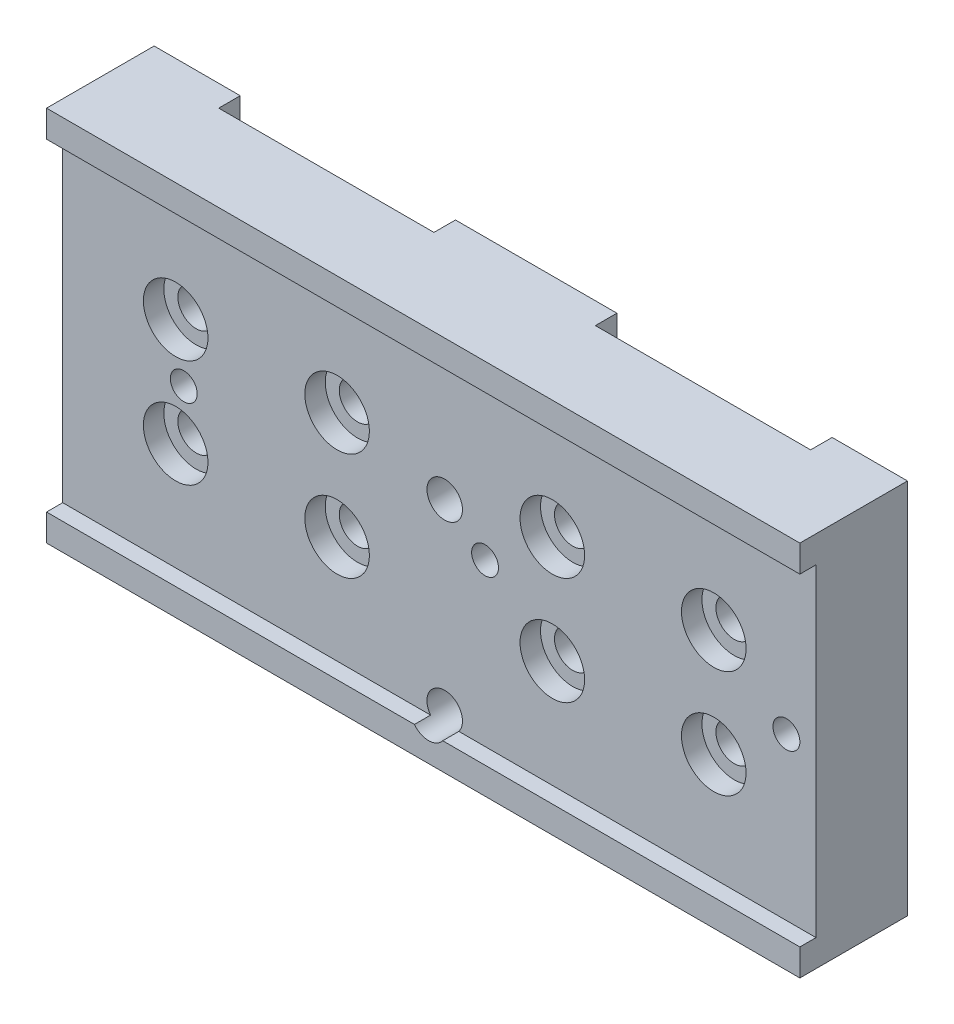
ISO-10303-21;
HEADER;
FILE_DESCRIPTION(('STEP AP214'),'2;1');
FILE_NAME('part.step','',(''),(''),'','','');
FILE_SCHEMA(('AUTOMOTIVE_DESIGN { 1 0 10303 214 1 1 1 1 }'));
ENDSEC;
DATA;
#1=APPLICATION_CONTEXT('core data for automotive mechanical design processes');
#2=APPLICATION_PROTOCOL_DEFINITION('international standard','automotive_design',2000,#1);
#3=PRODUCT_CONTEXT('',#1,'mechanical');
#4=PRODUCT('Part','Part','',(#3));
#5=PRODUCT_RELATED_PRODUCT_CATEGORY('part','',(#4));
#6=PRODUCT_DEFINITION_FORMATION('','',#4);
#7=PRODUCT_DEFINITION_CONTEXT('part definition',#1,'design');
#8=PRODUCT_DEFINITION('design','',#6,#7);
#9=PRODUCT_DEFINITION_SHAPE('','',#8);
#10=(LENGTH_UNIT() NAMED_UNIT(*) SI_UNIT(.MILLI.,.METRE.));
#11=(NAMED_UNIT(*) PLANE_ANGLE_UNIT() SI_UNIT($,.RADIAN.));
#12=(NAMED_UNIT(*) SI_UNIT($,.STERADIAN.) SOLID_ANGLE_UNIT());
#13=UNCERTAINTY_MEASURE_WITH_UNIT(LENGTH_MEASURE(1.E-05),#10,'distance_accuracy_value','');
#14=(GEOMETRIC_REPRESENTATION_CONTEXT(3) GLOBAL_UNCERTAINTY_ASSIGNED_CONTEXT((#13)) GLOBAL_UNIT_ASSIGNED_CONTEXT((#10,
#11,#12)) REPRESENTATION_CONTEXT('',''));
#15=CARTESIAN_POINT('',(0.,0.,0.));
#16=DIRECTION('',(0.,0.,1.));
#17=DIRECTION('',(1.,0.,0.));
#18=AXIS2_PLACEMENT_3D('',#15,#16,#17);
#19=CARTESIAN_POINT('',(12.,0.8,10.));
#20=DIRECTION('',(0.,-1.,0.));
#21=DIRECTION('',(1.,0.,0.));
#22=AXIS2_PLACEMENT_3D('',#19,#20,#21);
#23=PLANE('',#22);
#24=DIRECTION('',(-1.,0.,0.));
#25=VECTOR('',#24,1.);
#26=CARTESIAN_POINT('',(12.,0.8,10.));
#27=LINE('',#26,#25);
#28=CARTESIAN_POINT('',(-23.8124404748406,0.8,10.));
#29=VERTEX_POINT('',#28);
#30=CARTESIAN_POINT('',(-58.,0.799999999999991,10.));
#31=VERTEX_POINT('',#30);
#32=EDGE_CURVE('E147',#29,#31,#27,.T.);
#33=ORIENTED_EDGE('',*,*,#32,.F.);
#34=DIRECTION('',(0.,0.,-1.));
#35=VECTOR('',#34,1.);
#36=CARTESIAN_POINT('',(-23.8124404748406,0.8,0.));
#37=LINE('',#36,#35);
#38=CARTESIAN_POINT('',(-23.8124404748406,0.8,8.5));
#39=VERTEX_POINT('',#38);
#40=EDGE_CURVE('E11',#29,#39,#37,.T.);
#41=ORIENTED_EDGE('',*,*,#40,.T.);
#42=DIRECTION('',(-1.,0.,0.));
#43=VECTOR('',#42,1.);
#44=CARTESIAN_POINT('',(12.,0.8,8.5));
#45=LINE('',#44,#43);
#46=CARTESIAN_POINT('',(-58.,0.799999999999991,8.5));
#47=VERTEX_POINT('',#46);
#48=EDGE_CURVE('E160',#39,#47,#45,.T.);
#49=ORIENTED_EDGE('',*,*,#48,.T.);
#50=DIRECTION('',(0.,0.,1.));
#51=VECTOR('',#50,1.);
#52=CARTESIAN_POINT('',(-58.,0.799999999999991,10.));
#53=LINE('',#52,#51);
#54=EDGE_CURVE('E154',#47,#31,#53,.T.);
#55=ORIENTED_EDGE('',*,*,#54,.T.);
#56=EDGE_LOOP('',(#33,#41,#49,#55));
#57=FACE_BOUND('',#56,.T.);
#58=ADVANCED_FACE('F16',(#57),#23,.F.);
#59=CARTESIAN_POINT('',(0.,0.,10.));
#60=DIRECTION('',(0.,0.,-1.));
#61=DIRECTION('',(-1.,0.,0.));
#62=AXIS2_PLACEMENT_3D('',#59,#60,#61);
#63=PLANE('',#62);
#64=CARTESIAN_POINT('',(12.,0.8,10.));
#65=VERTEX_POINT('',#64);
#66=CARTESIAN_POINT('',(-21.1875595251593,0.8,10.));
#67=VERTEX_POINT('',#66);
#68=EDGE_CURVE('E150',#65,#67,#27,.T.);
#69=ORIENTED_EDGE('',*,*,#68,.T.);
#70=CARTESIAN_POINT('',(-22.5,1.80000000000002,10.));
#71=DIRECTION('',(0.,0.,-1.));
#72=DIRECTION('',(-1.,0.,0.));
#73=AXIS2_PLACEMENT_3D('',#70,#71,#72);
#74=CIRCLE('',#73,1.65);
#75=EDGE_CURVE('E31',#67,#29,#74,.T.);
#76=ORIENTED_EDGE('',*,*,#75,.T.);
#77=ORIENTED_EDGE('',*,*,#32,.T.);
#78=DIRECTION('',(0.,-1.,0.));
#79=VECTOR('',#78,1.);
#80=CARTESIAN_POINT('',(-58.,33.3,10.));
#81=LINE('',#80,#79);
#82=CARTESIAN_POINT('',(-58.,-1.7,10.));
#83=VERTEX_POINT('',#82);
#84=EDGE_CURVE('E306',#31,#83,#81,.T.);
#85=ORIENTED_EDGE('',*,*,#84,.T.);
#86=DIRECTION('',(1.,0.,0.));
#87=VECTOR('',#86,1.);
#88=CARTESIAN_POINT('',(12.,-1.7,10.));
#89=LINE('',#88,#87);
#90=CARTESIAN_POINT('',(12.,-1.7,10.));
#91=VERTEX_POINT('',#90);
#92=EDGE_CURVE('E310',#83,#91,#89,.T.);
#93=ORIENTED_EDGE('',*,*,#92,.T.);
#94=DIRECTION('',(0.,1.,0.));
#95=VECTOR('',#94,1.);
#96=CARTESIAN_POINT('',(12.,33.3,10.));
#97=LINE('',#96,#95);
#98=EDGE_CURVE('E301',#91,#65,#97,.T.);
#99=ORIENTED_EDGE('',*,*,#98,.T.);
#100=EDGE_LOOP('',(#69,#76,#77,#85,#93,#99));
#101=FACE_BOUND('',#100,.T.);
#102=ADVANCED_FACE('F146',(#101),#63,.F.);
#103=CARTESIAN_POINT('',(0.,0.,0.));
#104=DIRECTION('',(0.,0.,-1.));
#105=DIRECTION('',(-1.,0.,0.));
#106=AXIS2_PLACEMENT_3D('',#103,#104,#105);
#107=PLANE('',#106);
#108=DIRECTION('',(0.,-1.,0.));
#109=VECTOR('',#108,1.);
#110=CARTESIAN_POINT('',(-50.,33.3,0.));
#111=LINE('',#110,#109);
#112=CARTESIAN_POINT('',(-50.,33.3,0.));
#113=VERTEX_POINT('',#112);
#114=CARTESIAN_POINT('',(-50.,-1.7,0.));
#115=VERTEX_POINT('',#114);
#116=EDGE_CURVE('E265',#113,#115,#111,.T.);
#117=ORIENTED_EDGE('',*,*,#116,.T.);
#118=DIRECTION('',(1.,0.,0.));
#119=VECTOR('',#118,1.);
#120=CARTESIAN_POINT('',(12.,-1.7,0.));
#121=LINE('',#120,#119);
#122=CARTESIAN_POINT('',(-58.,-1.7,0.));
#123=VERTEX_POINT('',#122);
#124=EDGE_CURVE('E323',#123,#115,#121,.T.);
#125=ORIENTED_EDGE('',*,*,#124,.F.);
#126=DIRECTION('',(0.,-1.,0.));
#127=VECTOR('',#126,1.);
#128=CARTESIAN_POINT('',(-58.,33.3,0.));
#129=LINE('',#128,#127);
#130=CARTESIAN_POINT('',(-58.,33.3,0.));
#131=VERTEX_POINT('',#130);
#132=EDGE_CURVE('E319',#131,#123,#129,.T.);
#133=ORIENTED_EDGE('',*,*,#132,.F.);
#134=DIRECTION('',(-1.,0.,0.));
#135=VECTOR('',#134,1.);
#136=CARTESIAN_POINT('',(12.,33.3,0.));
#137=LINE('',#136,#135);
#138=EDGE_CURVE('E315',#113,#131,#137,.T.);
#139=ORIENTED_EDGE('',*,*,#138,.F.);
#140=EDGE_LOOP('',(#117,#125,#133,#139));
#141=FACE_BOUND('',#140,.T.);
#142=ADVANCED_FACE('F445',(#141),#107,.T.);
#143=CARTESIAN_POINT('',(9.25,15.8,0.));
#144=DIRECTION('',(0.,0.,1.));
#145=DIRECTION('',(1.,0.,0.));
#146=AXIS2_PLACEMENT_3D('',#143,#144,#145);
#147=CIRCLE('',#146,1.25);
#148=CARTESIAN_POINT('',(10.5,15.8,0.));
#149=VERTEX_POINT('',#148);
#150=EDGE_CURVE('E388',#149,#149,#147,.T.);
#151=ORIENTED_EDGE('',*,*,#150,.T.);
#152=EDGE_LOOP('',(#151));
#153=FACE_BOUND('',#152,.T.);
#154=DIRECTION('',(0.,-1.,0.));
#155=VECTOR('',#154,1.);
#156=CARTESIAN_POINT('',(5.,33.3,0.));
#157=LINE('',#156,#155);
#158=CARTESIAN_POINT('',(5.,33.3,0.));
#159=VERTEX_POINT('',#158);
#160=CARTESIAN_POINT('',(5.,-1.7,0.));
#161=VERTEX_POINT('',#160);
#162=EDGE_CURVE('E292',#159,#161,#157,.T.);
#163=ORIENTED_EDGE('',*,*,#162,.F.);
#164=CARTESIAN_POINT('',(12.,33.3,0.));
#165=VERTEX_POINT('',#164);
#166=EDGE_CURVE('E316',#165,#159,#137,.T.);
#167=ORIENTED_EDGE('',*,*,#166,.F.);
#168=DIRECTION('',(0.,1.,0.));
#169=VECTOR('',#168,1.);
#170=CARTESIAN_POINT('',(12.,33.3,0.));
#171=LINE('',#170,#169);
#172=CARTESIAN_POINT('',(12.,-1.7,0.));
#173=VERTEX_POINT('',#172);
#174=EDGE_CURVE('E294',#173,#165,#171,.T.);
#175=ORIENTED_EDGE('',*,*,#174,.F.);
#176=EDGE_CURVE('E322',#161,#173,#121,.T.);
#177=ORIENTED_EDGE('',*,*,#176,.F.);
#178=EDGE_LOOP('',(#163,#167,#175,#177));
#179=FACE_BOUND('',#178,.T.);
#180=ADVANCED_FACE('F600',(#153,#179),#107,.T.);
#181=CARTESIAN_POINT('',(12.,33.3,10.));
#182=DIRECTION('',(-1.,0.,0.));
#183=DIRECTION('',(0.,-1.,0.));
#184=AXIS2_PLACEMENT_3D('',#181,#182,#183);
#185=PLANE('',#184);
#186=DIRECTION('',(0.,-1.,0.));
#187=VECTOR('',#186,1.);
#188=CARTESIAN_POINT('',(12.,0.8,8.5));
#189=LINE('',#188,#187);
#190=CARTESIAN_POINT('',(12.,30.8,8.5));
#191=VERTEX_POINT('',#190);
#192=CARTESIAN_POINT('',(12.,0.8,8.5));
#193=VERTEX_POINT('',#192);
#194=EDGE_CURVE('E393',#191,#193,#189,.T.);
#195=ORIENTED_EDGE('',*,*,#194,.T.);
#196=DIRECTION('',(0.,0.,1.));
#197=VECTOR('',#196,1.);
#198=CARTESIAN_POINT('',(12.,0.8,10.));
#199=LINE('',#198,#197);
#200=EDGE_CURVE('E169',#193,#65,#199,.T.);
#201=ORIENTED_EDGE('',*,*,#200,.T.);
#202=ORIENTED_EDGE('',*,*,#98,.F.);
#203=DIRECTION('',(0.,0.,-1.));
#204=VECTOR('',#203,1.);
#205=CARTESIAN_POINT('',(12.,-1.7,10.));
#206=LINE('',#205,#204);
#207=EDGE_CURVE('E312',#91,#173,#206,.T.);
#208=ORIENTED_EDGE('',*,*,#207,.T.);
#209=ORIENTED_EDGE('',*,*,#174,.T.);
#210=DIRECTION('',(0.,0.,-1.));
#211=VECTOR('',#210,1.);
#212=CARTESIAN_POINT('',(12.,33.3,10.));
#213=LINE('',#212,#211);
#214=CARTESIAN_POINT('',(12.,33.3,10.));
#215=VERTEX_POINT('',#214);
#216=EDGE_CURVE('E335',#215,#165,#213,.T.);
#217=ORIENTED_EDGE('',*,*,#216,.F.);
#218=CARTESIAN_POINT('',(12.,30.8,10.));
#219=VERTEX_POINT('',#218);
#220=EDGE_CURVE('E304',#219,#215,#97,.T.);
#221=ORIENTED_EDGE('',*,*,#220,.F.);
#222=DIRECTION('',(0.,0.,-1.));
#223=VECTOR('',#222,1.);
#224=CARTESIAN_POINT('',(12.,30.8,10.));
#225=LINE('',#224,#223);
#226=EDGE_CURVE('E39',#219,#191,#225,.T.);
#227=ORIENTED_EDGE('',*,*,#226,.T.);
#228=EDGE_LOOP('',(#195,#201,#202,#208,#209,#217,#221,#227));
#229=FACE_BOUND('',#228,.T.);
#230=ADVANCED_FACE('F18',(#229),#185,.F.);
#231=CARTESIAN_POINT('',(12.,33.3,10.));
#232=DIRECTION('',(0.,-1.,0.));
#233=DIRECTION('',(1.,0.,0.));
#234=AXIS2_PLACEMENT_3D('',#231,#232,#233);
#235=PLANE('',#234);
#236=DIRECTION('',(-1.,0.,0.));
#237=VECTOR('',#236,1.);
#238=CARTESIAN_POINT('',(-50.,33.3,2.));
#239=LINE('',#238,#237);
#240=CARTESIAN_POINT('',(-30.,33.3,2.));
#241=VERTEX_POINT('',#240);
#242=CARTESIAN_POINT('',(-50.,33.3,2.));
#243=VERTEX_POINT('',#242);
#244=EDGE_CURVE('E250',#241,#243,#239,.T.);
#245=ORIENTED_EDGE('',*,*,#244,.T.);
#246=DIRECTION('',(0.,0.,-1.));
#247=VECTOR('',#246,1.);
#248=CARTESIAN_POINT('',(-50.,33.3,0.));
#249=LINE('',#248,#247);
#250=EDGE_CURVE('E254',#243,#113,#249,.T.);
#251=ORIENTED_EDGE('',*,*,#250,.T.);
#252=ORIENTED_EDGE('',*,*,#138,.T.);
#253=DIRECTION('',(0.,0.,-1.));
#254=VECTOR('',#253,1.);
#255=CARTESIAN_POINT('',(-58.,33.3,10.));
#256=LINE('',#255,#254);
#257=CARTESIAN_POINT('',(-58.,33.3,10.));
#258=VERTEX_POINT('',#257);
#259=EDGE_CURVE('E332',#258,#131,#256,.T.);
#260=ORIENTED_EDGE('',*,*,#259,.F.);
#261=DIRECTION('',(-1.,0.,0.));
#262=VECTOR('',#261,1.);
#263=CARTESIAN_POINT('',(12.,33.3,10.));
#264=LINE('',#263,#262);
#265=EDGE_CURVE('E303',#215,#258,#264,.T.);
#266=ORIENTED_EDGE('',*,*,#265,.F.);
#267=ORIENTED_EDGE('',*,*,#216,.T.);
#268=ORIENTED_EDGE('',*,*,#166,.T.);
#269=DIRECTION('',(0.,0.,1.));
#270=VECTOR('',#269,1.);
#271=CARTESIAN_POINT('',(5.,33.3,0.));
#272=LINE('',#271,#270);
#273=CARTESIAN_POINT('',(5.,33.3,2.));
#274=VERTEX_POINT('',#273);
#275=EDGE_CURVE('E274',#159,#274,#272,.T.);
#276=ORIENTED_EDGE('',*,*,#275,.T.);
#277=DIRECTION('',(-1.,0.,0.));
#278=VECTOR('',#277,1.);
#279=CARTESIAN_POINT('',(5.,33.3,2.));
#280=LINE('',#279,#278);
#281=CARTESIAN_POINT('',(-15.,33.3,2.));
#282=VERTEX_POINT('',#281);
#283=EDGE_CURVE('E277',#274,#282,#280,.T.);
#284=ORIENTED_EDGE('',*,*,#283,.T.);
#285=DIRECTION('',(0.,0.,-1.));
#286=VECTOR('',#285,1.);
#287=CARTESIAN_POINT('',(-15.,33.3,0.));
#288=LINE('',#287,#286);
#289=CARTESIAN_POINT('',(-15.,33.3,0.));
#290=VERTEX_POINT('',#289);
#291=EDGE_CURVE('E281',#282,#290,#288,.T.);
#292=ORIENTED_EDGE('',*,*,#291,.T.);
#293=CARTESIAN_POINT('',(-30.,33.3,0.));
#294=VERTEX_POINT('',#293);
#295=EDGE_CURVE('E320',#290,#294,#137,.T.);
#296=ORIENTED_EDGE('',*,*,#295,.T.);
#297=DIRECTION('',(0.,0.,1.));
#298=VECTOR('',#297,1.);
#299=CARTESIAN_POINT('',(-30.,33.3,0.));
#300=LINE('',#299,#298);
#301=EDGE_CURVE('E247',#294,#241,#300,.T.);
#302=ORIENTED_EDGE('',*,*,#301,.T.);
#303=EDGE_LOOP('',(#245,#251,#252,#260,#266,#267,#268,#276,#284,#292,#296,#302));
#304=FACE_BOUND('',#303,.T.);
#305=ADVANCED_FACE('F420',(#304),#235,.F.);
#306=CARTESIAN_POINT('',(-58.,33.3,10.));
#307=DIRECTION('',(1.,0.,0.));
#308=DIRECTION('',(0.,1.,0.));
#309=AXIS2_PLACEMENT_3D('',#306,#307,#308);
#310=PLANE('',#309);
#311=ORIENTED_EDGE('',*,*,#84,.F.);
#312=ORIENTED_EDGE('',*,*,#54,.F.);
#313=DIRECTION('',(0.,-1.,0.));
#314=VECTOR('',#313,1.);
#315=CARTESIAN_POINT('',(-58.,0.799999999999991,8.5));
#316=LINE('',#315,#314);
#317=CARTESIAN_POINT('',(-58.,30.8,8.5));
#318=VERTEX_POINT('',#317);
#319=EDGE_CURVE('E398',#318,#47,#316,.T.);
#320=ORIENTED_EDGE('',*,*,#319,.F.);
#321=DIRECTION('',(0.,0.,-1.));
#322=VECTOR('',#321,1.);
#323=CARTESIAN_POINT('',(-58.,30.8,10.));
#324=LINE('',#323,#322);
#325=CARTESIAN_POINT('',(-58.,30.8,10.));
#326=VERTEX_POINT('',#325);
#327=EDGE_CURVE('E391',#326,#318,#324,.T.);
#328=ORIENTED_EDGE('',*,*,#327,.F.);
#329=EDGE_CURVE('E307',#258,#326,#81,.T.);
#330=ORIENTED_EDGE('',*,*,#329,.F.);
#331=ORIENTED_EDGE('',*,*,#259,.T.);
#332=ORIENTED_EDGE('',*,*,#132,.T.);
#333=DIRECTION('',(0.,0.,-1.));
#334=VECTOR('',#333,1.);
#335=CARTESIAN_POINT('',(-58.,-1.7,10.));
#336=LINE('',#335,#334);
#337=EDGE_CURVE('E329',#83,#123,#336,.T.);
#338=ORIENTED_EDGE('',*,*,#337,.F.);
#339=EDGE_LOOP('',(#311,#312,#320,#328,#330,#331,#332,#338));
#340=FACE_BOUND('',#339,.T.);
#341=ADVANCED_FACE('F402',(#340),#310,.F.);
#342=CARTESIAN_POINT('',(12.,-1.7,10.));
#343=DIRECTION('',(0.,1.,0.));
#344=DIRECTION('',(-1.,0.,0.));
#345=AXIS2_PLACEMENT_3D('',#342,#343,#344);
#346=PLANE('',#345);
#347=ORIENTED_EDGE('',*,*,#124,.T.);
#348=DIRECTION('',(0.,0.,-1.));
#349=VECTOR('',#348,1.);
#350=CARTESIAN_POINT('',(-50.,-1.7,0.));
#351=LINE('',#350,#349);
#352=CARTESIAN_POINT('',(-50.,-1.7,2.));
#353=VERTEX_POINT('',#352);
#354=EDGE_CURVE('E251',#353,#115,#351,.T.);
#355=ORIENTED_EDGE('',*,*,#354,.F.);
#356=DIRECTION('',(-1.,0.,0.));
#357=VECTOR('',#356,1.);
#358=CARTESIAN_POINT('',(-50.,-1.7,2.));
#359=LINE('',#358,#357);
#360=CARTESIAN_POINT('',(-30.,-1.7,2.));
#361=VERTEX_POINT('',#360);
#362=EDGE_CURVE('E261',#361,#353,#359,.T.);
#363=ORIENTED_EDGE('',*,*,#362,.F.);
#364=DIRECTION('',(0.,0.,1.));
#365=VECTOR('',#364,1.);
#366=CARTESIAN_POINT('',(-30.,-1.7,0.));
#367=LINE('',#366,#365);
#368=CARTESIAN_POINT('',(-30.,-1.7,0.));
#369=VERTEX_POINT('',#368);
#370=EDGE_CURVE('E258',#369,#361,#367,.T.);
#371=ORIENTED_EDGE('',*,*,#370,.F.);
#372=CARTESIAN_POINT('',(-15.,-1.7,0.));
#373=VERTEX_POINT('',#372);
#374=EDGE_CURVE('E326',#369,#373,#121,.T.);
#375=ORIENTED_EDGE('',*,*,#374,.T.);
#376=DIRECTION('',(0.,0.,-1.));
#377=VECTOR('',#376,1.);
#378=CARTESIAN_POINT('',(-15.,-1.7,0.));
#379=LINE('',#378,#377);
#380=CARTESIAN_POINT('',(-15.,-1.7,2.));
#381=VERTEX_POINT('',#380);
#382=EDGE_CURVE('E278',#381,#373,#379,.T.);
#383=ORIENTED_EDGE('',*,*,#382,.F.);
#384=DIRECTION('',(-1.,0.,0.));
#385=VECTOR('',#384,1.);
#386=CARTESIAN_POINT('',(5.,-1.7,2.));
#387=LINE('',#386,#385);
#388=CARTESIAN_POINT('',(5.,-1.7,2.));
#389=VERTEX_POINT('',#388);
#390=EDGE_CURVE('E287',#389,#381,#387,.T.);
#391=ORIENTED_EDGE('',*,*,#390,.F.);
#392=DIRECTION('',(0.,0.,1.));
#393=VECTOR('',#392,1.);
#394=CARTESIAN_POINT('',(5.,-1.7,0.));
#395=LINE('',#394,#393);
#396=EDGE_CURVE('E268',#161,#389,#395,.T.);
#397=ORIENTED_EDGE('',*,*,#396,.F.);
#398=ORIENTED_EDGE('',*,*,#176,.T.);
#399=ORIENTED_EDGE('',*,*,#207,.F.);
#400=ORIENTED_EDGE('',*,*,#92,.F.);
#401=ORIENTED_EDGE('',*,*,#337,.T.);
#402=EDGE_LOOP('',(#347,#355,#363,#371,#375,#383,#391,#397,#398,#399,#400,#401));
#403=FACE_BOUND('',#402,.T.);
#404=ADVANCED_FACE('F408',(#403),#346,.F.);
#405=ORIENTED_EDGE('',*,*,#329,.T.);
#406=DIRECTION('',(-1.,0.,0.));
#407=VECTOR('',#406,1.);
#408=CARTESIAN_POINT('',(12.,30.8,10.));
#409=LINE('',#408,#407);
#410=EDGE_CURVE('E167',#219,#326,#409,.T.);
#411=ORIENTED_EDGE('',*,*,#410,.F.);
#412=ORIENTED_EDGE('',*,*,#220,.T.);
#413=ORIENTED_EDGE('',*,*,#265,.T.);
#414=EDGE_LOOP('',(#405,#411,#412,#413));
#415=FACE_BOUND('',#414,.T.);
#416=ADVANCED_FACE('F417',(#415),#63,.F.);
#417=CARTESIAN_POINT('',(-22.5,1.80000000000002,0.));
#418=DIRECTION('',(0.,0.,-1.));
#419=DIRECTION('',(-1.,0.,0.));
#420=AXIS2_PLACEMENT_3D('',#417,#418,#419);
#421=CIRCLE('',#420,1.65);
#422=CARTESIAN_POINT('',(-24.15,1.80000000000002,0.));
#423=VERTEX_POINT('',#422);
#424=EDGE_CURVE('E151',#423,#423,#421,.T.);
#425=ORIENTED_EDGE('',*,*,#424,.F.);
#426=EDGE_LOOP('',(#425));
#427=FACE_BOUND('',#426,.T.);
#428=CARTESIAN_POINT('',(-22.5,18.8,0.));
#429=DIRECTION('',(0.,0.,-1.));
#430=DIRECTION('',(-1.,0.,0.));
#431=AXIS2_PLACEMENT_3D('',#428,#429,#430);
#432=CIRCLE('',#431,1.65);
#433=CARTESIAN_POINT('',(-24.15,18.8,0.));
#434=VERTEX_POINT('',#433);
#435=EDGE_CURVE('E359',#434,#434,#432,.T.);
#436=ORIENTED_EDGE('',*,*,#435,.F.);
#437=EDGE_LOOP('',(#436));
#438=FACE_BOUND('',#437,.T.);
#439=CARTESIAN_POINT('',(-18.75,15.8,0.));
#440=DIRECTION('',(0.,0.,1.));
#441=DIRECTION('',(1.,0.,0.));
#442=AXIS2_PLACEMENT_3D('',#439,#440,#441);
#443=CIRCLE('',#442,1.25);
#444=CARTESIAN_POINT('',(-17.5,15.8,0.));
#445=VERTEX_POINT('',#444);
#446=EDGE_CURVE('E382',#445,#445,#443,.T.);
#447=ORIENTED_EDGE('',*,*,#446,.T.);
#448=EDGE_LOOP('',(#447));
#449=FACE_BOUND('',#448,.T.);
#450=DIRECTION('',(0.,-1.,0.));
#451=VECTOR('',#450,1.);
#452=CARTESIAN_POINT('',(-30.,33.3,0.));
#453=LINE('',#452,#451);
#454=EDGE_CURVE('E257',#294,#369,#453,.T.);
#455=ORIENTED_EDGE('',*,*,#454,.F.);
#456=ORIENTED_EDGE('',*,*,#295,.F.);
#457=DIRECTION('',(0.,-1.,0.));
#458=VECTOR('',#457,1.);
#459=CARTESIAN_POINT('',(-15.,33.3,0.));
#460=LINE('',#459,#458);
#461=EDGE_CURVE('E295',#290,#373,#460,.T.);
#462=ORIENTED_EDGE('',*,*,#461,.T.);
#463=ORIENTED_EDGE('',*,*,#374,.F.);
#464=EDGE_LOOP('',(#455,#456,#462,#463));
#465=FACE_BOUND('',#464,.T.);
#466=ADVANCED_FACE('F593',(#427,#438,#449,#465),#107,.T.);
#467=CARTESIAN_POINT('',(5.,33.3,0.));
#468=DIRECTION('',(1.,0.,0.));
#469=DIRECTION('',(0.,1.,0.));
#470=AXIS2_PLACEMENT_3D('',#467,#468,#469);
#471=PLANE('',#470);
#472=ORIENTED_EDGE('',*,*,#396,.T.);
#473=DIRECTION('',(0.,-1.,0.));
#474=VECTOR('',#473,1.);
#475=CARTESIAN_POINT('',(5.,33.3,2.));
#476=LINE('',#475,#474);
#477=EDGE_CURVE('E284',#274,#389,#476,.T.);
#478=ORIENTED_EDGE('',*,*,#477,.F.);
#479=ORIENTED_EDGE('',*,*,#275,.F.);
#480=ORIENTED_EDGE('',*,*,#162,.T.);
#481=EDGE_LOOP('',(#472,#478,#479,#480));
#482=FACE_BOUND('',#481,.T.);
#483=ADVANCED_FACE('F587',(#482),#471,.F.);
#484=CARTESIAN_POINT('',(-15.,33.3,0.));
#485=DIRECTION('',(-1.,0.,0.));
#486=DIRECTION('',(0.,-1.,0.));
#487=AXIS2_PLACEMENT_3D('',#484,#485,#486);
#488=PLANE('',#487);
#489=ORIENTED_EDGE('',*,*,#382,.T.);
#490=ORIENTED_EDGE('',*,*,#461,.F.);
#491=ORIENTED_EDGE('',*,*,#291,.F.);
#492=DIRECTION('',(0.,-1.,0.));
#493=VECTOR('',#492,1.);
#494=CARTESIAN_POINT('',(-15.,33.3,2.));
#495=LINE('',#494,#493);
#496=EDGE_CURVE('E298',#282,#381,#495,.T.);
#497=ORIENTED_EDGE('',*,*,#496,.T.);
#498=EDGE_LOOP('',(#489,#490,#491,#497));
#499=FACE_BOUND('',#498,.T.);
#500=ADVANCED_FACE('F584',(#499),#488,.F.);
#501=CARTESIAN_POINT('',(5.,33.3,2.));
#502=DIRECTION('',(0.,0.,1.));
#503=DIRECTION('',(1.,0.,0.));
#504=AXIS2_PLACEMENT_3D('',#501,#502,#503);
#505=PLANE('',#504);
#506=CARTESIAN_POINT('',(2.5,10.8,2.));
#507=DIRECTION('',(0.,0.,1.));
#508=DIRECTION('',(1.,0.,0.));
#509=AXIS2_PLACEMENT_3D('',#506,#507,#508);
#510=CIRCLE('',#509,1.7);
#511=CARTESIAN_POINT('',(4.2,10.8,2.));
#512=VERTEX_POINT('',#511);
#513=EDGE_CURVE('E197',#512,#512,#510,.T.);
#514=ORIENTED_EDGE('',*,*,#513,.T.);
#515=EDGE_LOOP('',(#514));
#516=FACE_BOUND('',#515,.T.);
#517=CARTESIAN_POINT('',(2.5,20.8,2.));
#518=DIRECTION('',(0.,0.,1.));
#519=DIRECTION('',(1.,0.,0.));
#520=AXIS2_PLACEMENT_3D('',#517,#518,#519);
#521=CIRCLE('',#520,1.7);
#522=CARTESIAN_POINT('',(4.2,20.8,2.));
#523=VERTEX_POINT('',#522);
#524=EDGE_CURVE('E204',#523,#523,#521,.T.);
#525=ORIENTED_EDGE('',*,*,#524,.T.);
#526=EDGE_LOOP('',(#525));
#527=FACE_BOUND('',#526,.T.);
#528=CARTESIAN_POINT('',(-12.5,20.8,2.));
#529=DIRECTION('',(0.,0.,1.));
#530=DIRECTION('',(1.,0.,0.));
#531=AXIS2_PLACEMENT_3D('',#528,#529,#530);
#532=CIRCLE('',#531,1.7);
#533=CARTESIAN_POINT('',(-10.8,20.8,2.));
#534=VERTEX_POINT('',#533);
#535=EDGE_CURVE('E211',#534,#534,#532,.T.);
#536=ORIENTED_EDGE('',*,*,#535,.T.);
#537=EDGE_LOOP('',(#536));
#538=FACE_BOUND('',#537,.T.);
#539=CARTESIAN_POINT('',(-12.5,10.8,2.));
#540=DIRECTION('',(0.,0.,1.));
#541=DIRECTION('',(1.,0.,0.));
#542=AXIS2_PLACEMENT_3D('',#539,#540,#541);
#543=CIRCLE('',#542,1.7);
#544=CARTESIAN_POINT('',(-10.8,10.8,2.));
#545=VERTEX_POINT('',#544);
#546=EDGE_CURVE('E218',#545,#545,#543,.T.);
#547=ORIENTED_EDGE('',*,*,#546,.T.);
#548=EDGE_LOOP('',(#547));
#549=FACE_BOUND('',#548,.T.);
#550=ORIENTED_EDGE('',*,*,#390,.T.);
#551=ORIENTED_EDGE('',*,*,#496,.F.);
#552=ORIENTED_EDGE('',*,*,#283,.F.);
#553=ORIENTED_EDGE('',*,*,#477,.T.);
#554=EDGE_LOOP('',(#550,#551,#552,#553));
#555=FACE_BOUND('',#554,.T.);
#556=ADVANCED_FACE('F576',(#516,#527,#538,#549,#555),#505,.F.);
#557=CARTESIAN_POINT('',(-50.,33.3,0.));
#558=DIRECTION('',(-1.,0.,0.));
#559=DIRECTION('',(0.,-1.,0.));
#560=AXIS2_PLACEMENT_3D('',#557,#558,#559);
#561=PLANE('',#560);
#562=ORIENTED_EDGE('',*,*,#354,.T.);
#563=ORIENTED_EDGE('',*,*,#116,.F.);
#564=ORIENTED_EDGE('',*,*,#250,.F.);
#565=DIRECTION('',(0.,-1.,0.));
#566=VECTOR('',#565,1.);
#567=CARTESIAN_POINT('',(-50.,33.3,2.));
#568=LINE('',#567,#566);
#569=EDGE_CURVE('E269',#243,#353,#568,.T.);
#570=ORIENTED_EDGE('',*,*,#569,.T.);
#571=EDGE_LOOP('',(#562,#563,#564,#570));
#572=FACE_BOUND('',#571,.T.);
#573=ADVANCED_FACE('F572',(#572),#561,.F.);
#574=CARTESIAN_POINT('',(-50.,33.3,2.));
#575=DIRECTION('',(0.,0.,1.));
#576=DIRECTION('',(1.,0.,0.));
#577=AXIS2_PLACEMENT_3D('',#574,#575,#576);
#578=PLANE('',#577);
#579=CARTESIAN_POINT('',(-46.75,15.8,2.));
#580=DIRECTION('',(0.,0.,1.));
#581=DIRECTION('',(1.,0.,0.));
#582=AXIS2_PLACEMENT_3D('',#579,#580,#581);
#583=CIRCLE('',#582,1.25);
#584=CARTESIAN_POINT('',(-45.5,15.8,2.));
#585=VERTEX_POINT('',#584);
#586=EDGE_CURVE('E376',#585,#585,#583,.T.);
#587=ORIENTED_EDGE('',*,*,#586,.T.);
#588=EDGE_LOOP('',(#587));
#589=FACE_BOUND('',#588,.T.);
#590=CARTESIAN_POINT('',(-32.5,20.8,2.));
#591=DIRECTION('',(0.,0.,1.));
#592=DIRECTION('',(1.,0.,0.));
#593=AXIS2_PLACEMENT_3D('',#590,#591,#592);
#594=CIRCLE('',#593,1.7);
#595=CARTESIAN_POINT('',(-30.8,20.8,2.));
#596=VERTEX_POINT('',#595);
#597=EDGE_CURVE('E225',#596,#596,#594,.T.);
#598=ORIENTED_EDGE('',*,*,#597,.T.);
#599=EDGE_LOOP('',(#598));
#600=FACE_BOUND('',#599,.T.);
#601=CARTESIAN_POINT('',(-32.5,10.8,2.));
#602=DIRECTION('',(0.,0.,1.));
#603=DIRECTION('',(1.,0.,0.));
#604=AXIS2_PLACEMENT_3D('',#601,#602,#603);
#605=CIRCLE('',#604,1.7);
#606=CARTESIAN_POINT('',(-30.8,10.8,2.));
#607=VERTEX_POINT('',#606);
#608=EDGE_CURVE('E232',#607,#607,#605,.T.);
#609=ORIENTED_EDGE('',*,*,#608,.T.);
#610=EDGE_LOOP('',(#609));
#611=FACE_BOUND('',#610,.T.);
#612=CARTESIAN_POINT('',(-47.5,20.8,2.));
#613=DIRECTION('',(0.,0.,1.));
#614=DIRECTION('',(1.,0.,0.));
#615=AXIS2_PLACEMENT_3D('',#612,#613,#614);
#616=CIRCLE('',#615,1.7);
#617=CARTESIAN_POINT('',(-45.8,20.8,2.));
#618=VERTEX_POINT('',#617);
#619=EDGE_CURVE('E239',#618,#618,#616,.T.);
#620=ORIENTED_EDGE('',*,*,#619,.T.);
#621=EDGE_LOOP('',(#620));
#622=FACE_BOUND('',#621,.T.);
#623=CARTESIAN_POINT('',(-47.5,10.8,2.));
#624=DIRECTION('',(0.,0.,1.));
#625=DIRECTION('',(1.,0.,0.));
#626=AXIS2_PLACEMENT_3D('',#623,#624,#625);
#627=CIRCLE('',#626,1.7);
#628=CARTESIAN_POINT('',(-45.8,10.8,2.));
#629=VERTEX_POINT('',#628);
#630=EDGE_CURVE('E246',#629,#629,#627,.T.);
#631=ORIENTED_EDGE('',*,*,#630,.T.);
#632=EDGE_LOOP('',(#631));
#633=FACE_BOUND('',#632,.T.);
#634=ORIENTED_EDGE('',*,*,#362,.T.);
#635=ORIENTED_EDGE('',*,*,#569,.F.);
#636=ORIENTED_EDGE('',*,*,#244,.F.);
#637=DIRECTION('',(0.,-1.,0.));
#638=VECTOR('',#637,1.);
#639=CARTESIAN_POINT('',(-30.,33.3,2.));
#640=LINE('',#639,#638);
#641=EDGE_CURVE('E271',#241,#361,#640,.T.);
#642=ORIENTED_EDGE('',*,*,#641,.T.);
#643=EDGE_LOOP('',(#634,#635,#636,#642));
#644=FACE_BOUND('',#643,.T.);
#645=ADVANCED_FACE('F575',(#589,#600,#611,#622,#633,#644),#578,.F.);
#646=CARTESIAN_POINT('',(-30.,33.3,0.));
#647=DIRECTION('',(1.,0.,0.));
#648=DIRECTION('',(0.,1.,0.));
#649=AXIS2_PLACEMENT_3D('',#646,#647,#648);
#650=PLANE('',#649);
#651=ORIENTED_EDGE('',*,*,#370,.T.);
#652=ORIENTED_EDGE('',*,*,#641,.F.);
#653=ORIENTED_EDGE('',*,*,#301,.F.);
#654=ORIENTED_EDGE('',*,*,#454,.T.);
#655=EDGE_LOOP('',(#651,#652,#653,#654));
#656=FACE_BOUND('',#655,.T.);
#657=ADVANCED_FACE('F570',(#656),#650,.F.);
#658=CARTESIAN_POINT('',(-47.5,10.8,10.));
#659=DIRECTION('',(0.,0.,1.));
#660=DIRECTION('',(1.,0.,0.));
#661=AXIS2_PLACEMENT_3D('',#658,#659,#660);
#662=CYLINDRICAL_SURFACE('',#661,1.7);
#663=CARTESIAN_POINT('',(-47.5,10.8,6.6));
#664=DIRECTION('',(0.,0.,1.));
#665=DIRECTION('',(1.,0.,0.));
#666=AXIS2_PLACEMENT_3D('',#663,#664,#665);
#667=CIRCLE('',#666,1.7);
#668=CARTESIAN_POINT('',(-45.8,10.8,6.6));
#669=VERTEX_POINT('',#668);
#670=EDGE_CURVE('E243',#669,#669,#667,.T.);
#671=ORIENTED_EDGE('',*,*,#670,.T.);
#672=EDGE_LOOP('',(#671));
#673=FACE_BOUND('',#672,.T.);
#674=ORIENTED_EDGE('',*,*,#630,.F.);
#675=EDGE_LOOP('',(#674));
#676=FACE_BOUND('',#675,.T.);
#677=ADVANCED_FACE('F566',(#673,#676),#662,.F.);
#678=CARTESIAN_POINT('',(-45.8,10.8,6.6));
#679=DIRECTION('',(0.,0.,-1.));
#680=DIRECTION('',(-1.,0.,0.));
#681=AXIS2_PLACEMENT_3D('',#678,#679,#680);
#682=PLANE('',#681);
#683=ORIENTED_EDGE('',*,*,#670,.F.);
#684=EDGE_LOOP('',(#683));
#685=FACE_BOUND('',#684,.T.);
#686=CARTESIAN_POINT('',(-47.5,10.8,6.6));
#687=DIRECTION('',(0.,0.,1.));
#688=DIRECTION('',(1.,0.,0.));
#689=AXIS2_PLACEMENT_3D('',#686,#687,#688);
#690=CIRCLE('',#689,3.);
#691=CARTESIAN_POINT('',(-44.5,10.8,6.6));
#692=VERTEX_POINT('',#691);
#693=EDGE_CURVE('E240',#692,#692,#690,.T.);
#694=ORIENTED_EDGE('',*,*,#693,.T.);
#695=EDGE_LOOP('',(#694));
#696=FACE_BOUND('',#695,.T.);
#697=ADVANCED_FACE('F562',(#685,#696),#682,.F.);
#698=CARTESIAN_POINT('',(-47.5,10.8,10.));
#699=DIRECTION('',(0.,0.,1.));
#700=DIRECTION('',(1.,0.,0.));
#701=AXIS2_PLACEMENT_3D('',#698,#699,#700);
#702=CYLINDRICAL_SURFACE('',#701,3.);
#703=CARTESIAN_POINT('',(-47.5,10.8,8.5));
#704=DIRECTION('',(0.,0.,-1.));
#705=DIRECTION('',(-1.,0.,0.));
#706=AXIS2_PLACEMENT_3D('',#703,#704,#705);
#707=CIRCLE('',#706,3.);
#708=CARTESIAN_POINT('',(-50.5,10.8,8.5));
#709=VERTEX_POINT('',#708);
#710=EDGE_CURVE('E188',#709,#709,#707,.F.);
#711=ORIENTED_EDGE('',*,*,#710,.T.);
#712=EDGE_LOOP('',(#711));
#713=FACE_BOUND('',#712,.T.);
#714=ORIENTED_EDGE('',*,*,#693,.F.);
#715=EDGE_LOOP('',(#714));
#716=FACE_BOUND('',#715,.T.);
#717=ADVANCED_FACE('F558',(#713,#716),#702,.F.);
#718=CARTESIAN_POINT('',(-47.5,20.8,10.));
#719=DIRECTION('',(0.,0.,1.));
#720=DIRECTION('',(1.,0.,0.));
#721=AXIS2_PLACEMENT_3D('',#718,#719,#720);
#722=CYLINDRICAL_SURFACE('',#721,1.7);
#723=CARTESIAN_POINT('',(-47.5,20.8,6.6));
#724=DIRECTION('',(0.,0.,1.));
#725=DIRECTION('',(1.,0.,0.));
#726=AXIS2_PLACEMENT_3D('',#723,#724,#725);
#727=CIRCLE('',#726,1.7);
#728=CARTESIAN_POINT('',(-45.8,20.8,6.6));
#729=VERTEX_POINT('',#728);
#730=EDGE_CURVE('E236',#729,#729,#727,.T.);
#731=ORIENTED_EDGE('',*,*,#730,.T.);
#732=EDGE_LOOP('',(#731));
#733=FACE_BOUND('',#732,.T.);
#734=ORIENTED_EDGE('',*,*,#619,.F.);
#735=EDGE_LOOP('',(#734));
#736=FACE_BOUND('',#735,.T.);
#737=ADVANCED_FACE('F554',(#733,#736),#722,.F.);
#738=CARTESIAN_POINT('',(-45.8,20.8,6.6));
#739=DIRECTION('',(0.,0.,-1.));
#740=DIRECTION('',(-1.,0.,0.));
#741=AXIS2_PLACEMENT_3D('',#738,#739,#740);
#742=PLANE('',#741);
#743=ORIENTED_EDGE('',*,*,#730,.F.);
#744=EDGE_LOOP('',(#743));
#745=FACE_BOUND('',#744,.T.);
#746=CARTESIAN_POINT('',(-47.5,20.8,6.6));
#747=DIRECTION('',(0.,0.,1.));
#748=DIRECTION('',(1.,0.,0.));
#749=AXIS2_PLACEMENT_3D('',#746,#747,#748);
#750=CIRCLE('',#749,3.);
#751=CARTESIAN_POINT('',(-44.5,20.8,6.6));
#752=VERTEX_POINT('',#751);
#753=EDGE_CURVE('E233',#752,#752,#750,.T.);
#754=ORIENTED_EDGE('',*,*,#753,.T.);
#755=EDGE_LOOP('',(#754));
#756=FACE_BOUND('',#755,.T.);
#757=ADVANCED_FACE('F550',(#745,#756),#742,.F.);
#758=CARTESIAN_POINT('',(-47.5,20.8,10.));
#759=DIRECTION('',(0.,0.,1.));
#760=DIRECTION('',(1.,0.,0.));
#761=AXIS2_PLACEMENT_3D('',#758,#759,#760);
#762=CYLINDRICAL_SURFACE('',#761,3.);
#763=CARTESIAN_POINT('',(-47.5,20.8,8.5));
#764=DIRECTION('',(0.,0.,-1.));
#765=DIRECTION('',(-1.,0.,0.));
#766=AXIS2_PLACEMENT_3D('',#763,#764,#765);
#767=CIRCLE('',#766,3.);
#768=CARTESIAN_POINT('',(-50.5,20.8,8.5));
#769=VERTEX_POINT('',#768);
#770=EDGE_CURVE('E185',#769,#769,#767,.F.);
#771=ORIENTED_EDGE('',*,*,#770,.T.);
#772=EDGE_LOOP('',(#771));
#773=FACE_BOUND('',#772,.T.);
#774=ORIENTED_EDGE('',*,*,#753,.F.);
#775=EDGE_LOOP('',(#774));
#776=FACE_BOUND('',#775,.T.);
#777=ADVANCED_FACE('F546',(#773,#776),#762,.F.);
#778=CARTESIAN_POINT('',(-32.5,10.8,10.));
#779=DIRECTION('',(0.,0.,1.));
#780=DIRECTION('',(1.,0.,0.));
#781=AXIS2_PLACEMENT_3D('',#778,#779,#780);
#782=CYLINDRICAL_SURFACE('',#781,1.7);
#783=CARTESIAN_POINT('',(-32.5,10.8,6.6));
#784=DIRECTION('',(0.,0.,1.));
#785=DIRECTION('',(1.,0.,0.));
#786=AXIS2_PLACEMENT_3D('',#783,#784,#785);
#787=CIRCLE('',#786,1.7);
#788=CARTESIAN_POINT('',(-30.8,10.8,6.6));
#789=VERTEX_POINT('',#788);
#790=EDGE_CURVE('E229',#789,#789,#787,.T.);
#791=ORIENTED_EDGE('',*,*,#790,.T.);
#792=EDGE_LOOP('',(#791));
#793=FACE_BOUND('',#792,.T.);
#794=ORIENTED_EDGE('',*,*,#608,.F.);
#795=EDGE_LOOP('',(#794));
#796=FACE_BOUND('',#795,.T.);
#797=ADVANCED_FACE('F542',(#793,#796),#782,.F.);
#798=CARTESIAN_POINT('',(-30.8,10.8,6.6));
#799=DIRECTION('',(0.,0.,-1.));
#800=DIRECTION('',(-1.,0.,0.));
#801=AXIS2_PLACEMENT_3D('',#798,#799,#800);
#802=PLANE('',#801);
#803=ORIENTED_EDGE('',*,*,#790,.F.);
#804=EDGE_LOOP('',(#803));
#805=FACE_BOUND('',#804,.T.);
#806=CARTESIAN_POINT('',(-32.5,10.8,6.6));
#807=DIRECTION('',(0.,0.,1.));
#808=DIRECTION('',(1.,0.,0.));
#809=AXIS2_PLACEMENT_3D('',#806,#807,#808);
#810=CIRCLE('',#809,3.);
#811=CARTESIAN_POINT('',(-29.5,10.8,6.6));
#812=VERTEX_POINT('',#811);
#813=EDGE_CURVE('E226',#812,#812,#810,.T.);
#814=ORIENTED_EDGE('',*,*,#813,.T.);
#815=EDGE_LOOP('',(#814));
#816=FACE_BOUND('',#815,.T.);
#817=ADVANCED_FACE('F538',(#805,#816),#802,.F.);
#818=CARTESIAN_POINT('',(-32.5,10.8,10.));
#819=DIRECTION('',(0.,0.,1.));
#820=DIRECTION('',(1.,0.,0.));
#821=AXIS2_PLACEMENT_3D('',#818,#819,#820);
#822=CYLINDRICAL_SURFACE('',#821,3.);
#823=CARTESIAN_POINT('',(-32.5,10.8,8.5));
#824=DIRECTION('',(0.,0.,-1.));
#825=DIRECTION('',(-1.,0.,0.));
#826=AXIS2_PLACEMENT_3D('',#823,#824,#825);
#827=CIRCLE('',#826,3.);
#828=CARTESIAN_POINT('',(-35.5,10.8,8.5));
#829=VERTEX_POINT('',#828);
#830=EDGE_CURVE('E182',#829,#829,#827,.F.);
#831=ORIENTED_EDGE('',*,*,#830,.T.);
#832=EDGE_LOOP('',(#831));
#833=FACE_BOUND('',#832,.T.);
#834=ORIENTED_EDGE('',*,*,#813,.F.);
#835=EDGE_LOOP('',(#834));
#836=FACE_BOUND('',#835,.T.);
#837=ADVANCED_FACE('F534',(#833,#836),#822,.F.);
#838=CARTESIAN_POINT('',(-32.5,20.8,10.));
#839=DIRECTION('',(0.,0.,1.));
#840=DIRECTION('',(1.,0.,0.));
#841=AXIS2_PLACEMENT_3D('',#838,#839,#840);
#842=CYLINDRICAL_SURFACE('',#841,1.7);
#843=CARTESIAN_POINT('',(-32.5,20.8,6.6));
#844=DIRECTION('',(0.,0.,1.));
#845=DIRECTION('',(1.,0.,0.));
#846=AXIS2_PLACEMENT_3D('',#843,#844,#845);
#847=CIRCLE('',#846,1.7);
#848=CARTESIAN_POINT('',(-30.8,20.8,6.6));
#849=VERTEX_POINT('',#848);
#850=EDGE_CURVE('E222',#849,#849,#847,.T.);
#851=ORIENTED_EDGE('',*,*,#850,.T.);
#852=EDGE_LOOP('',(#851));
#853=FACE_BOUND('',#852,.T.);
#854=ORIENTED_EDGE('',*,*,#597,.F.);
#855=EDGE_LOOP('',(#854));
#856=FACE_BOUND('',#855,.T.);
#857=ADVANCED_FACE('F530',(#853,#856),#842,.F.);
#858=CARTESIAN_POINT('',(-30.8,20.8,6.6));
#859=DIRECTION('',(0.,0.,-1.));
#860=DIRECTION('',(-1.,0.,0.));
#861=AXIS2_PLACEMENT_3D('',#858,#859,#860);
#862=PLANE('',#861);
#863=ORIENTED_EDGE('',*,*,#850,.F.);
#864=EDGE_LOOP('',(#863));
#865=FACE_BOUND('',#864,.T.);
#866=CARTESIAN_POINT('',(-32.5,20.8,6.6));
#867=DIRECTION('',(0.,0.,1.));
#868=DIRECTION('',(1.,0.,0.));
#869=AXIS2_PLACEMENT_3D('',#866,#867,#868);
#870=CIRCLE('',#869,3.);
#871=CARTESIAN_POINT('',(-29.5,20.8,6.6));
#872=VERTEX_POINT('',#871);
#873=EDGE_CURVE('E219',#872,#872,#870,.T.);
#874=ORIENTED_EDGE('',*,*,#873,.T.);
#875=EDGE_LOOP('',(#874));
#876=FACE_BOUND('',#875,.T.);
#877=ADVANCED_FACE('F526',(#865,#876),#862,.F.);
#878=CARTESIAN_POINT('',(-32.5,20.8,10.));
#879=DIRECTION('',(0.,0.,1.));
#880=DIRECTION('',(1.,0.,0.));
#881=AXIS2_PLACEMENT_3D('',#878,#879,#880);
#882=CYLINDRICAL_SURFACE('',#881,3.);
#883=CARTESIAN_POINT('',(-32.5,20.8,8.5));
#884=DIRECTION('',(0.,0.,-1.));
#885=DIRECTION('',(-1.,0.,0.));
#886=AXIS2_PLACEMENT_3D('',#883,#884,#885);
#887=CIRCLE('',#886,3.);
#888=CARTESIAN_POINT('',(-35.5,20.8,8.5));
#889=VERTEX_POINT('',#888);
#890=EDGE_CURVE('E179',#889,#889,#887,.F.);
#891=ORIENTED_EDGE('',*,*,#890,.T.);
#892=EDGE_LOOP('',(#891));
#893=FACE_BOUND('',#892,.T.);
#894=ORIENTED_EDGE('',*,*,#873,.F.);
#895=EDGE_LOOP('',(#894));
#896=FACE_BOUND('',#895,.T.);
#897=ADVANCED_FACE('F522',(#893,#896),#882,.F.);
#898=CARTESIAN_POINT('',(-12.5,10.8,10.));
#899=DIRECTION('',(0.,0.,1.));
#900=DIRECTION('',(1.,0.,0.));
#901=AXIS2_PLACEMENT_3D('',#898,#899,#900);
#902=CYLINDRICAL_SURFACE('',#901,1.7);
#903=CARTESIAN_POINT('',(-12.5,10.8,6.6));
#904=DIRECTION('',(0.,0.,1.));
#905=DIRECTION('',(1.,0.,0.));
#906=AXIS2_PLACEMENT_3D('',#903,#904,#905);
#907=CIRCLE('',#906,1.7);
#908=CARTESIAN_POINT('',(-10.8,10.8,6.6));
#909=VERTEX_POINT('',#908);
#910=EDGE_CURVE('E215',#909,#909,#907,.T.);
#911=ORIENTED_EDGE('',*,*,#910,.T.);
#912=EDGE_LOOP('',(#911));
#913=FACE_BOUND('',#912,.T.);
#914=ORIENTED_EDGE('',*,*,#546,.F.);
#915=EDGE_LOOP('',(#914));
#916=FACE_BOUND('',#915,.T.);
#917=ADVANCED_FACE('F518',(#913,#916),#902,.F.);
#918=CARTESIAN_POINT('',(-10.8,10.8,6.6));
#919=DIRECTION('',(0.,0.,-1.));
#920=DIRECTION('',(-1.,0.,0.));
#921=AXIS2_PLACEMENT_3D('',#918,#919,#920);
#922=PLANE('',#921);
#923=ORIENTED_EDGE('',*,*,#910,.F.);
#924=EDGE_LOOP('',(#923));
#925=FACE_BOUND('',#924,.T.);
#926=CARTESIAN_POINT('',(-12.5,10.8,6.6));
#927=DIRECTION('',(0.,0.,1.));
#928=DIRECTION('',(1.,0.,0.));
#929=AXIS2_PLACEMENT_3D('',#926,#927,#928);
#930=CIRCLE('',#929,3.);
#931=CARTESIAN_POINT('',(-9.5,10.8,6.6));
#932=VERTEX_POINT('',#931);
#933=EDGE_CURVE('E212',#932,#932,#930,.T.);
#934=ORIENTED_EDGE('',*,*,#933,.T.);
#935=EDGE_LOOP('',(#934));
#936=FACE_BOUND('',#935,.T.);
#937=ADVANCED_FACE('F514',(#925,#936),#922,.F.);
#938=CARTESIAN_POINT('',(-12.5,10.8,10.));
#939=DIRECTION('',(0.,0.,1.));
#940=DIRECTION('',(1.,0.,0.));
#941=AXIS2_PLACEMENT_3D('',#938,#939,#940);
#942=CYLINDRICAL_SURFACE('',#941,3.);
#943=CARTESIAN_POINT('',(-12.5,10.8,8.5));
#944=DIRECTION('',(0.,0.,-1.));
#945=DIRECTION('',(-1.,0.,0.));
#946=AXIS2_PLACEMENT_3D('',#943,#944,#945);
#947=CIRCLE('',#946,3.);
#948=CARTESIAN_POINT('',(-15.5,10.8,8.5));
#949=VERTEX_POINT('',#948);
#950=EDGE_CURVE('E176',#949,#949,#947,.F.);
#951=ORIENTED_EDGE('',*,*,#950,.T.);
#952=EDGE_LOOP('',(#951));
#953=FACE_BOUND('',#952,.T.);
#954=ORIENTED_EDGE('',*,*,#933,.F.);
#955=EDGE_LOOP('',(#954));
#956=FACE_BOUND('',#955,.T.);
#957=ADVANCED_FACE('F510',(#953,#956),#942,.F.);
#958=CARTESIAN_POINT('',(-12.5,20.8,10.));
#959=DIRECTION('',(0.,0.,1.));
#960=DIRECTION('',(1.,0.,0.));
#961=AXIS2_PLACEMENT_3D('',#958,#959,#960);
#962=CYLINDRICAL_SURFACE('',#961,1.7);
#963=CARTESIAN_POINT('',(-12.5,20.8,6.6));
#964=DIRECTION('',(0.,0.,1.));
#965=DIRECTION('',(1.,0.,0.));
#966=AXIS2_PLACEMENT_3D('',#963,#964,#965);
#967=CIRCLE('',#966,1.7);
#968=CARTESIAN_POINT('',(-10.8,20.8,6.6));
#969=VERTEX_POINT('',#968);
#970=EDGE_CURVE('E208',#969,#969,#967,.T.);
#971=ORIENTED_EDGE('',*,*,#970,.T.);
#972=EDGE_LOOP('',(#971));
#973=FACE_BOUND('',#972,.T.);
#974=ORIENTED_EDGE('',*,*,#535,.F.);
#975=EDGE_LOOP('',(#974));
#976=FACE_BOUND('',#975,.T.);
#977=ADVANCED_FACE('F506',(#973,#976),#962,.F.);
#978=CARTESIAN_POINT('',(-10.8,20.8,6.6));
#979=DIRECTION('',(0.,0.,-1.));
#980=DIRECTION('',(-1.,0.,0.));
#981=AXIS2_PLACEMENT_3D('',#978,#979,#980);
#982=PLANE('',#981);
#983=ORIENTED_EDGE('',*,*,#970,.F.);
#984=EDGE_LOOP('',(#983));
#985=FACE_BOUND('',#984,.T.);
#986=CARTESIAN_POINT('',(-12.5,20.8,6.6));
#987=DIRECTION('',(0.,0.,1.));
#988=DIRECTION('',(1.,0.,0.));
#989=AXIS2_PLACEMENT_3D('',#986,#987,#988);
#990=CIRCLE('',#989,3.);
#991=CARTESIAN_POINT('',(-9.5,20.8,6.6));
#992=VERTEX_POINT('',#991);
#993=EDGE_CURVE('E205',#992,#992,#990,.T.);
#994=ORIENTED_EDGE('',*,*,#993,.T.);
#995=EDGE_LOOP('',(#994));
#996=FACE_BOUND('',#995,.T.);
#997=ADVANCED_FACE('F502',(#985,#996),#982,.F.);
#998=CARTESIAN_POINT('',(-12.5,20.8,10.));
#999=DIRECTION('',(0.,0.,1.));
#1000=DIRECTION('',(1.,0.,0.));
#1001=AXIS2_PLACEMENT_3D('',#998,#999,#1000);
#1002=CYLINDRICAL_SURFACE('',#1001,3.);
#1003=CARTESIAN_POINT('',(-12.5,20.8,8.5));
#1004=DIRECTION('',(0.,0.,-1.));
#1005=DIRECTION('',(-1.,0.,0.));
#1006=AXIS2_PLACEMENT_3D('',#1003,#1004,#1005);
#1007=CIRCLE('',#1006,3.);
#1008=CARTESIAN_POINT('',(-15.5,20.8,8.5));
#1009=VERTEX_POINT('',#1008);
#1010=EDGE_CURVE('E173',#1009,#1009,#1007,.F.);
#1011=ORIENTED_EDGE('',*,*,#1010,.T.);
#1012=EDGE_LOOP('',(#1011));
#1013=FACE_BOUND('',#1012,.T.);
#1014=ORIENTED_EDGE('',*,*,#993,.F.);
#1015=EDGE_LOOP('',(#1014));
#1016=FACE_BOUND('',#1015,.T.);
#1017=ADVANCED_FACE('F498',(#1013,#1016),#1002,.F.);
#1018=CARTESIAN_POINT('',(2.5,20.8,10.));
#1019=DIRECTION('',(0.,0.,1.));
#1020=DIRECTION('',(1.,0.,0.));
#1021=AXIS2_PLACEMENT_3D('',#1018,#1019,#1020);
#1022=CYLINDRICAL_SURFACE('',#1021,1.7);
#1023=CARTESIAN_POINT('',(2.5,20.8,6.6));
#1024=DIRECTION('',(0.,0.,1.));
#1025=DIRECTION('',(1.,0.,0.));
#1026=AXIS2_PLACEMENT_3D('',#1023,#1024,#1025);
#1027=CIRCLE('',#1026,1.7);
#1028=CARTESIAN_POINT('',(4.2,20.8,6.6));
#1029=VERTEX_POINT('',#1028);
#1030=EDGE_CURVE('E201',#1029,#1029,#1027,.T.);
#1031=ORIENTED_EDGE('',*,*,#1030,.T.);
#1032=EDGE_LOOP('',(#1031));
#1033=FACE_BOUND('',#1032,.T.);
#1034=ORIENTED_EDGE('',*,*,#524,.F.);
#1035=EDGE_LOOP('',(#1034));
#1036=FACE_BOUND('',#1035,.T.);
#1037=ADVANCED_FACE('F494',(#1033,#1036),#1022,.F.);
#1038=CARTESIAN_POINT('',(4.2,20.8,6.6));
#1039=DIRECTION('',(0.,0.,-1.));
#1040=DIRECTION('',(-1.,0.,0.));
#1041=AXIS2_PLACEMENT_3D('',#1038,#1039,#1040);
#1042=PLANE('',#1041);
#1043=ORIENTED_EDGE('',*,*,#1030,.F.);
#1044=EDGE_LOOP('',(#1043));
#1045=FACE_BOUND('',#1044,.T.);
#1046=CARTESIAN_POINT('',(2.5,20.8,6.6));
#1047=DIRECTION('',(0.,0.,1.));
#1048=DIRECTION('',(1.,0.,0.));
#1049=AXIS2_PLACEMENT_3D('',#1046,#1047,#1048);
#1050=CIRCLE('',#1049,3.);
#1051=CARTESIAN_POINT('',(5.5,20.8,6.6));
#1052=VERTEX_POINT('',#1051);
#1053=EDGE_CURVE('E198',#1052,#1052,#1050,.T.);
#1054=ORIENTED_EDGE('',*,*,#1053,.T.);
#1055=EDGE_LOOP('',(#1054));
#1056=FACE_BOUND('',#1055,.T.);
#1057=ADVANCED_FACE('F490',(#1045,#1056),#1042,.F.);
#1058=CARTESIAN_POINT('',(2.5,20.8,10.));
#1059=DIRECTION('',(0.,0.,1.));
#1060=DIRECTION('',(1.,0.,0.));
#1061=AXIS2_PLACEMENT_3D('',#1058,#1059,#1060);
#1062=CYLINDRICAL_SURFACE('',#1061,3.);
#1063=CARTESIAN_POINT('',(2.5,20.8,8.5));
#1064=DIRECTION('',(0.,0.,-1.));
#1065=DIRECTION('',(-1.,0.,0.));
#1066=AXIS2_PLACEMENT_3D('',#1063,#1064,#1065);
#1067=CIRCLE('',#1066,3.);
#1068=CARTESIAN_POINT('',(-0.5,20.8,8.5));
#1069=VERTEX_POINT('',#1068);
#1070=EDGE_CURVE('E170',#1069,#1069,#1067,.F.);
#1071=ORIENTED_EDGE('',*,*,#1070,.T.);
#1072=EDGE_LOOP('',(#1071));
#1073=FACE_BOUND('',#1072,.T.);
#1074=ORIENTED_EDGE('',*,*,#1053,.F.);
#1075=EDGE_LOOP('',(#1074));
#1076=FACE_BOUND('',#1075,.T.);
#1077=ADVANCED_FACE('F483',(#1073,#1076),#1062,.F.);
#1078=CARTESIAN_POINT('',(2.5,10.8,10.));
#1079=DIRECTION('',(0.,0.,1.));
#1080=DIRECTION('',(1.,0.,0.));
#1081=AXIS2_PLACEMENT_3D('',#1078,#1079,#1080);
#1082=CYLINDRICAL_SURFACE('',#1081,1.7);
#1083=CARTESIAN_POINT('',(2.5,10.8,6.6));
#1084=DIRECTION('',(0.,0.,1.));
#1085=DIRECTION('',(1.,0.,0.));
#1086=AXIS2_PLACEMENT_3D('',#1083,#1084,#1085);
#1087=CIRCLE('',#1086,1.7);
#1088=CARTESIAN_POINT('',(4.2,10.8,6.6));
#1089=VERTEX_POINT('',#1088);
#1090=EDGE_CURVE('E194',#1089,#1089,#1087,.T.);
#1091=ORIENTED_EDGE('',*,*,#1090,.T.);
#1092=EDGE_LOOP('',(#1091));
#1093=FACE_BOUND('',#1092,.T.);
#1094=ORIENTED_EDGE('',*,*,#513,.F.);
#1095=EDGE_LOOP('',(#1094));
#1096=FACE_BOUND('',#1095,.T.);
#1097=ADVANCED_FACE('F476',(#1093,#1096),#1082,.F.);
#1098=CARTESIAN_POINT('',(4.2,10.8,6.6));
#1099=DIRECTION('',(0.,0.,-1.));
#1100=DIRECTION('',(-1.,0.,0.));
#1101=AXIS2_PLACEMENT_3D('',#1098,#1099,#1100);
#1102=PLANE('',#1101);
#1103=ORIENTED_EDGE('',*,*,#1090,.F.);
#1104=EDGE_LOOP('',(#1103));
#1105=FACE_BOUND('',#1104,.T.);
#1106=CARTESIAN_POINT('',(2.5,10.8,6.6));
#1107=DIRECTION('',(0.,0.,1.));
#1108=DIRECTION('',(1.,0.,0.));
#1109=AXIS2_PLACEMENT_3D('',#1106,#1107,#1108);
#1110=CIRCLE('',#1109,3.);
#1111=CARTESIAN_POINT('',(5.5,10.8,6.6));
#1112=VERTEX_POINT('',#1111);
#1113=EDGE_CURVE('E191',#1112,#1112,#1110,.T.);
#1114=ORIENTED_EDGE('',*,*,#1113,.T.);
#1115=EDGE_LOOP('',(#1114));
#1116=FACE_BOUND('',#1115,.T.);
#1117=ADVANCED_FACE('F455',(#1105,#1116),#1102,.F.);
#1118=CARTESIAN_POINT('',(2.5,10.8,10.));
#1119=DIRECTION('',(0.,0.,1.));
#1120=DIRECTION('',(1.,0.,0.));
#1121=AXIS2_PLACEMENT_3D('',#1118,#1119,#1120);
#1122=CYLINDRICAL_SURFACE('',#1121,3.);
#1123=CARTESIAN_POINT('',(2.5,10.8,8.5));
#1124=DIRECTION('',(0.,0.,-1.));
#1125=DIRECTION('',(-1.,0.,0.));
#1126=AXIS2_PLACEMENT_3D('',#1123,#1124,#1125);
#1127=CIRCLE('',#1126,3.);
#1128=CARTESIAN_POINT('',(-0.5,10.8,8.5));
#1129=VERTEX_POINT('',#1128);
#1130=EDGE_CURVE('E158',#1129,#1129,#1127,.F.);
#1131=ORIENTED_EDGE('',*,*,#1130,.T.);
#1132=EDGE_LOOP('',(#1131));
#1133=FACE_BOUND('',#1132,.T.);
#1134=ORIENTED_EDGE('',*,*,#1113,.F.);
#1135=EDGE_LOOP('',(#1134));
#1136=FACE_BOUND('',#1135,.T.);
#1137=ADVANCED_FACE('F449',(#1133,#1136),#1122,.F.);
#1138=CARTESIAN_POINT('',(12.,0.8,8.5));
#1139=DIRECTION('',(0.,0.,-1.));
#1140=DIRECTION('',(-1.,0.,0.));
#1141=AXIS2_PLACEMENT_3D('',#1138,#1139,#1140);
#1142=PLANE('',#1141);
#1143=CARTESIAN_POINT('',(-22.5,18.8,8.5));
#1144=DIRECTION('',(0.,0.,-1.));
#1145=DIRECTION('',(-1.,0.,0.));
#1146=AXIS2_PLACEMENT_3D('',#1143,#1144,#1145);
#1147=CIRCLE('',#1146,1.65);
#1148=CARTESIAN_POINT('',(-24.15,18.8,8.5));
#1149=VERTEX_POINT('',#1148);
#1150=EDGE_CURVE('E356',#1149,#1149,#1147,.T.);
#1151=ORIENTED_EDGE('',*,*,#1150,.T.);
#1152=EDGE_LOOP('',(#1151));
#1153=FACE_BOUND('',#1152,.T.);
#1154=CARTESIAN_POINT('',(-46.75,15.8,8.5));
#1155=DIRECTION('',(0.,0.,1.));
#1156=DIRECTION('',(1.,0.,0.));
#1157=AXIS2_PLACEMENT_3D('',#1154,#1155,#1156);
#1158=CIRCLE('',#1157,1.25);
#1159=CARTESIAN_POINT('',(-45.5,15.8,8.5));
#1160=VERTEX_POINT('',#1159);
#1161=EDGE_CURVE('E358',#1160,#1160,#1158,.T.);
#1162=ORIENTED_EDGE('',*,*,#1161,.F.);
#1163=EDGE_LOOP('',(#1162));
#1164=FACE_BOUND('',#1163,.T.);
#1165=CARTESIAN_POINT('',(-18.75,15.8,8.5));
#1166=DIRECTION('',(0.,0.,1.));
#1167=DIRECTION('',(1.,0.,0.));
#1168=AXIS2_PLACEMENT_3D('',#1165,#1166,#1167);
#1169=CIRCLE('',#1168,1.25);
#1170=CARTESIAN_POINT('',(-17.5,15.8,8.5));
#1171=VERTEX_POINT('',#1170);
#1172=EDGE_CURVE('E379',#1171,#1171,#1169,.T.);
#1173=ORIENTED_EDGE('',*,*,#1172,.F.);
#1174=EDGE_LOOP('',(#1173));
#1175=FACE_BOUND('',#1174,.T.);
#1176=CARTESIAN_POINT('',(9.25,15.8,8.5));
#1177=DIRECTION('',(0.,0.,1.));
#1178=DIRECTION('',(1.,0.,0.));
#1179=AXIS2_PLACEMENT_3D('',#1176,#1177,#1178);
#1180=CIRCLE('',#1179,1.25);
#1181=CARTESIAN_POINT('',(10.5,15.8,8.5));
#1182=VERTEX_POINT('',#1181);
#1183=EDGE_CURVE('E385',#1182,#1182,#1180,.T.);
#1184=ORIENTED_EDGE('',*,*,#1183,.F.);
#1185=EDGE_LOOP('',(#1184));
#1186=FACE_BOUND('',#1185,.T.);
#1187=ORIENTED_EDGE('',*,*,#770,.F.);
#1188=EDGE_LOOP('',(#1187));
#1189=FACE_BOUND('',#1188,.T.);
#1190=ORIENTED_EDGE('',*,*,#890,.F.);
#1191=EDGE_LOOP('',(#1190));
#1192=FACE_BOUND('',#1191,.T.);
#1193=ORIENTED_EDGE('',*,*,#1010,.F.);
#1194=EDGE_LOOP('',(#1193));
#1195=FACE_BOUND('',#1194,.T.);
#1196=ORIENTED_EDGE('',*,*,#1130,.F.);
#1197=EDGE_LOOP('',(#1196));
#1198=FACE_BOUND('',#1197,.T.);
#1199=ORIENTED_EDGE('',*,*,#48,.F.);
#1200=CARTESIAN_POINT('',(-22.5,1.80000000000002,8.5));
#1201=DIRECTION('',(0.,0.,-1.));
#1202=DIRECTION('',(-1.,0.,0.));
#1203=AXIS2_PLACEMENT_3D('',#1200,#1201,#1202);
#1204=CIRCLE('',#1203,1.65);
#1205=CARTESIAN_POINT('',(-21.1875595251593,0.8,8.5));
#1206=VERTEX_POINT('',#1205);
#1207=EDGE_CURVE('E140',#39,#1206,#1204,.T.);
#1208=ORIENTED_EDGE('',*,*,#1207,.T.);
#1209=EDGE_CURVE('E156',#193,#1206,#45,.T.);
#1210=ORIENTED_EDGE('',*,*,#1209,.F.);
#1211=ORIENTED_EDGE('',*,*,#194,.F.);
#1212=DIRECTION('',(-1.,0.,0.));
#1213=VECTOR('',#1212,1.);
#1214=CARTESIAN_POINT('',(12.,30.8,8.5));
#1215=LINE('',#1214,#1213);
#1216=EDGE_CURVE('E165',#191,#318,#1215,.T.);
#1217=ORIENTED_EDGE('',*,*,#1216,.T.);
#1218=ORIENTED_EDGE('',*,*,#319,.T.);
#1219=EDGE_LOOP('',(#1199,#1208,#1210,#1211,#1217,#1218));
#1220=FACE_BOUND('',#1219,.T.);
#1221=ORIENTED_EDGE('',*,*,#1070,.F.);
#1222=EDGE_LOOP('',(#1221));
#1223=FACE_BOUND('',#1222,.T.);
#1224=ORIENTED_EDGE('',*,*,#950,.F.);
#1225=EDGE_LOOP('',(#1224));
#1226=FACE_BOUND('',#1225,.T.);
#1227=ORIENTED_EDGE('',*,*,#830,.F.);
#1228=EDGE_LOOP('',(#1227));
#1229=FACE_BOUND('',#1228,.T.);
#1230=ORIENTED_EDGE('',*,*,#710,.F.);
#1231=EDGE_LOOP('',(#1230));
#1232=FACE_BOUND('',#1231,.T.);
#1233=ADVANCED_FACE('F365',(#1153,#1164,#1175,#1186,#1189,#1192,#1195,#1198,#1220,#1223,#1226,
#1229,#1232),#1142,.F.);
#1234=ORIENTED_EDGE('',*,*,#1209,.T.);
#1235=DIRECTION('',(0.,0.,-1.));
#1236=VECTOR('',#1235,1.);
#1237=CARTESIAN_POINT('',(-21.1875595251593,0.8,0.));
#1238=LINE('',#1237,#1236);
#1239=EDGE_CURVE('E24',#1206,#67,#1238,.F.);
#1240=ORIENTED_EDGE('',*,*,#1239,.T.);
#1241=ORIENTED_EDGE('',*,*,#68,.F.);
#1242=ORIENTED_EDGE('',*,*,#200,.F.);
#1243=EDGE_LOOP('',(#1234,#1240,#1241,#1242));
#1244=FACE_BOUND('',#1243,.T.);
#1245=ADVANCED_FACE('F361',(#1244),#23,.F.);
#1246=CARTESIAN_POINT('',(12.,30.8,10.));
#1247=DIRECTION('',(0.,1.,0.));
#1248=DIRECTION('',(-1.,0.,0.));
#1249=AXIS2_PLACEMENT_3D('',#1246,#1247,#1248);
#1250=PLANE('',#1249);
#1251=ORIENTED_EDGE('',*,*,#327,.T.);
#1252=ORIENTED_EDGE('',*,*,#1216,.F.);
#1253=ORIENTED_EDGE('',*,*,#226,.F.);
#1254=ORIENTED_EDGE('',*,*,#410,.T.);
#1255=EDGE_LOOP('',(#1251,#1252,#1253,#1254));
#1256=FACE_BOUND('',#1255,.T.);
#1257=ADVANCED_FACE('F424',(#1256),#1250,.F.);
#1258=CARTESIAN_POINT('',(9.25,15.8,8.5));
#1259=DIRECTION('',(0.,0.,1.));
#1260=DIRECTION('',(1.,0.,0.));
#1261=AXIS2_PLACEMENT_3D('',#1258,#1259,#1260);
#1262=CYLINDRICAL_SURFACE('',#1261,1.25);
#1263=ORIENTED_EDGE('',*,*,#150,.F.);
#1264=EDGE_LOOP('',(#1263));
#1265=FACE_BOUND('',#1264,.T.);
#1266=ORIENTED_EDGE('',*,*,#1183,.T.);
#1267=EDGE_LOOP('',(#1266));
#1268=FACE_BOUND('',#1267,.T.);
#1269=ADVANCED_FACE('F426',(#1265,#1268),#1262,.F.);
#1270=CARTESIAN_POINT('',(-18.75,15.8,8.5));
#1271=DIRECTION('',(0.,0.,1.));
#1272=DIRECTION('',(1.,0.,0.));
#1273=AXIS2_PLACEMENT_3D('',#1270,#1271,#1272);
#1274=CYLINDRICAL_SURFACE('',#1273,1.25);
#1275=ORIENTED_EDGE('',*,*,#446,.F.);
#1276=EDGE_LOOP('',(#1275));
#1277=FACE_BOUND('',#1276,.T.);
#1278=ORIENTED_EDGE('',*,*,#1172,.T.);
#1279=EDGE_LOOP('',(#1278));
#1280=FACE_BOUND('',#1279,.T.);
#1281=ADVANCED_FACE('F434',(#1277,#1280),#1274,.F.);
#1282=CARTESIAN_POINT('',(-46.75,15.8,8.5));
#1283=DIRECTION('',(0.,0.,1.));
#1284=DIRECTION('',(1.,0.,0.));
#1285=AXIS2_PLACEMENT_3D('',#1282,#1283,#1284);
#1286=CYLINDRICAL_SURFACE('',#1285,1.25);
#1287=ORIENTED_EDGE('',*,*,#1161,.T.);
#1288=EDGE_LOOP('',(#1287));
#1289=FACE_BOUND('',#1288,.T.);
#1290=ORIENTED_EDGE('',*,*,#586,.F.);
#1291=EDGE_LOOP('',(#1290));
#1292=FACE_BOUND('',#1291,.T.);
#1293=ADVANCED_FACE('F868',(#1289,#1292),#1286,.F.);
#1294=CARTESIAN_POINT('',(-22.5,18.8,0.));
#1295=DIRECTION('',(0.,0.,-1.));
#1296=DIRECTION('',(-1.,0.,0.));
#1297=AXIS2_PLACEMENT_3D('',#1294,#1295,#1296);
#1298=CYLINDRICAL_SURFACE('',#1297,1.65);
#1299=ORIENTED_EDGE('',*,*,#435,.T.);
#1300=EDGE_LOOP('',(#1299));
#1301=FACE_BOUND('',#1300,.T.);
#1302=ORIENTED_EDGE('',*,*,#1150,.F.);
#1303=EDGE_LOOP('',(#1302));
#1304=FACE_BOUND('',#1303,.T.);
#1305=ADVANCED_FACE('F877',(#1301,#1304),#1298,.F.);
#1306=CARTESIAN_POINT('',(-22.5,1.80000000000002,0.));
#1307=DIRECTION('',(0.,0.,-1.));
#1308=DIRECTION('',(-1.,0.,0.));
#1309=AXIS2_PLACEMENT_3D('',#1306,#1307,#1308);
#1310=CYLINDRICAL_SURFACE('',#1309,1.65);
#1311=ORIENTED_EDGE('',*,*,#424,.T.);
#1312=EDGE_LOOP('',(#1311));
#1313=FACE_BOUND('',#1312,.T.);
#1314=ORIENTED_EDGE('',*,*,#75,.F.);
#1315=ORIENTED_EDGE('',*,*,#1239,.F.);
#1316=ORIENTED_EDGE('',*,*,#1207,.F.);
#1317=ORIENTED_EDGE('',*,*,#40,.F.);
#1318=EDGE_LOOP('',(#1314,#1315,#1316,#1317));
#1319=FACE_BOUND('',#1318,.T.);
#1320=ADVANCED_FACE('F138',(#1313,#1319),#1310,.F.);
#1321=CLOSED_SHELL('',(#58,#102,#142,#180,#230,#305,#341,#404,#416,#466,#483,#500,#556,#573,
#645,#657,#677,#697,#717,#737,#757,#777,#797,#817,#837,#857,#877,#897,#917,#937,#957,#977,#997,
#1017,#1037,#1057,#1077,#1097,#1117,#1137,#1233,#1245,#1257,#1269,#1281,#1293,#1305,#1320));
#1322=MANIFOLD_SOLID_BREP('B1',#1321);
#1323=ADVANCED_BREP_SHAPE_REPRESENTATION('',(#18,#1322),#14);
#1324=SHAPE_DEFINITION_REPRESENTATION(#9,#1323);
ENDSEC;
END-ISO-10303-21;
